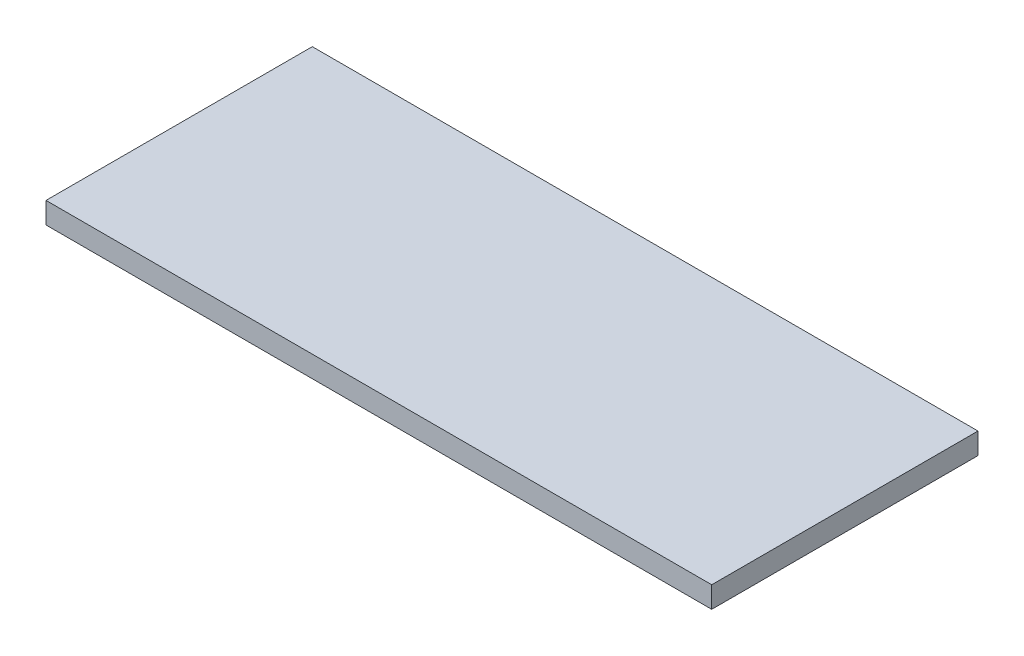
from build123d import *

# Parameters (mm, degrees)
SKETCH1_W           = 63.5
SKETCH1_H           = 25.4
BOSS_EXTRUDE1_DEPTH = 2.032


with BuildPart() as part:
    # Sketch1 → Boss-Extrude1 (new body)
    with BuildSketch(Plane(origin=(0, 0, 0), x_dir=(1, 0, 0), z_dir=(0, 1, 0))):
        Rectangle(SKETCH1_W, SKETCH1_H)
    extrude(amount=BOSS_EXTRUDE1_DEPTH)


solid = part.part
